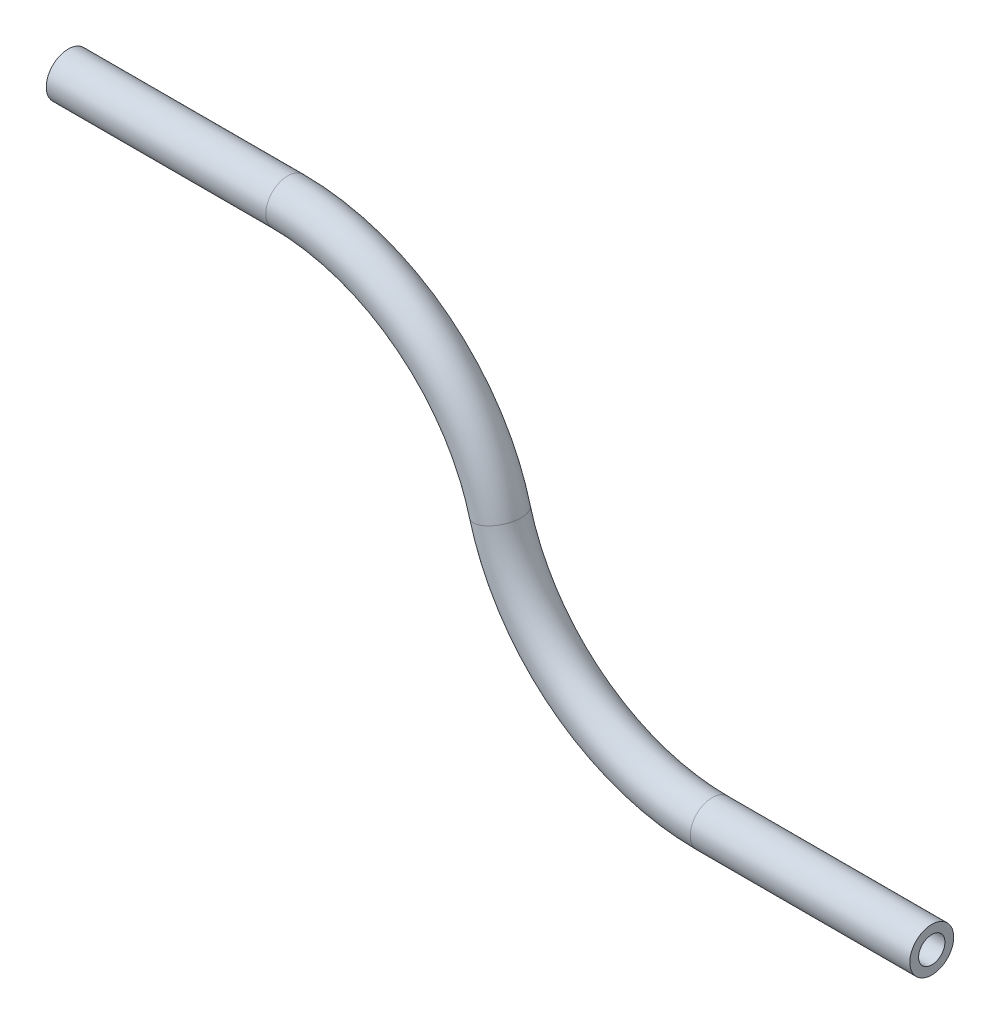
from build123d import *

# Parameters (mm, degrees)
ESQUISSE2_R   = 5
ESQUISSE2_R_2 = 3


with BuildPart() as part:
    # Balayage1: sweep along a path in Esquisse1
    with BuildLine(Plane.XY) as balayage1_path:
        Line((0, 0), (50, 0))
        ThreePointArc((50, 0), (80.47480173, -10.360544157), (98.3201823, -37.14854162))
        ThreePointArc((98.3201823, -37.14854162), (116.16556287, -63.936539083), (146.6403646, -74.29708324))
        Line((146.6403646, -74.29708324), (196.6403646, -74.29708324))
    # Esquisse2 → Balayage1 (sweep)
    with BuildSketch(Plane(origin=(0, 0, 0), x_dir=(0, 0, -1), z_dir=(1, 0, 0))):
        Circle(ESQUISSE2_R)
        Circle(ESQUISSE2_R_2, mode=Mode.SUBTRACT)
    sweep(path=balayage1_path.line)


solid = part.part
